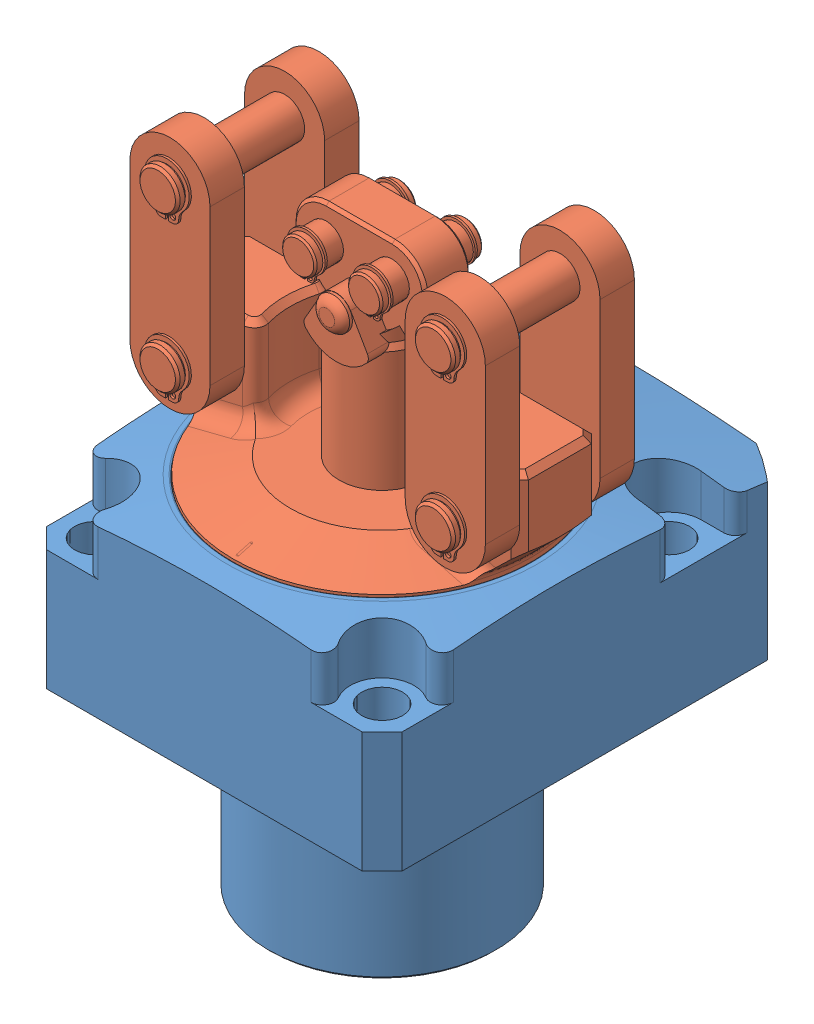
SolidWorks assembly ilcmv41621820.SLDASM, configuration Default (file format 13000). Lengths in mm.
Overall size (61.99 107.7 72.53).
2 component instances, 2 part files, 3 mates.
Components (placement in the parent):
- ilcmv41621820_BODY-2: ilcmv41621820_BODY.SLDPRT [Default] at (-17.4697 9.6005 -68.2044) size (61.99 62.26 72.53)
- ilcmv41621820_LUG-1: ilcmv41621820_LUG.SLDPRT [Default] at (-17.4697 30.6063 -68.2044) x (0 0 -1) z (1 0 0) size (51.92 54.99 61.98)
Mates (geometry in assembly coordinates):
- Concentric1: concentric: cylinder of ilmv41621820_BODY-2 through (-17.4697 0.6316 -68.2044) axis (0 -1 0) radius 26.0096; cylinder of ilmv41621820_LUG-1 through (-17.4697 47.2376 -68.2044) axis (0 1 0) radius 25.9588
- Coincident5: coincident: plane of ilmv41621820_BODY-2 through (8.5399 30.6063 -68.2044) normal (0 1 0); plane of ilmv41621820_LUG-1 through (-17.4697 30.6063 -61.2067) normal (0 -1 0)
- Perpendicular1: perpendicular: plane of ilmv41621820_BODY-2 through (-48.464 40.1567 -37.2101) normal (-1 0 0); plane of ilmv41621820_LUG-1 through (-41.4717 78.6123 -81.1965) normal (0 0 -1)
